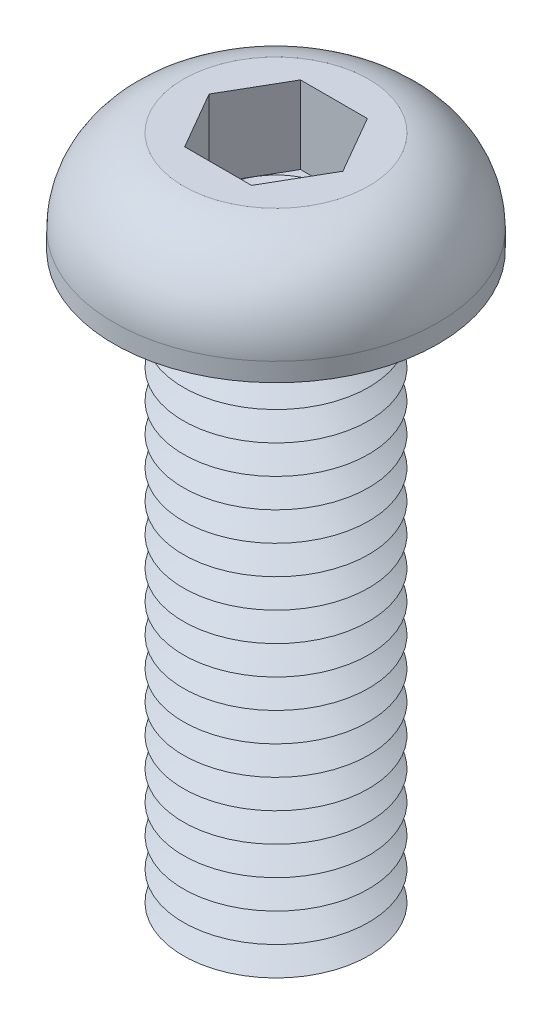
ISO-10303-21;
HEADER;
FILE_DESCRIPTION(('STEP AP214'),'2;1');
FILE_NAME('part.step','',(''),(''),'','','');
FILE_SCHEMA(('AUTOMOTIVE_DESIGN { 1 0 10303 214 1 1 1 1 }'));
ENDSEC;
DATA;
#1=APPLICATION_CONTEXT('core data for automotive mechanical design processes');
#2=APPLICATION_PROTOCOL_DEFINITION('international standard','automotive_design',2000,#1);
#3=PRODUCT_CONTEXT('',#1,'mechanical');
#4=PRODUCT('Part','Part','',(#3));
#5=PRODUCT_RELATED_PRODUCT_CATEGORY('part','',(#4));
#6=PRODUCT_DEFINITION_FORMATION('','',#4);
#7=PRODUCT_DEFINITION_CONTEXT('part definition',#1,'design');
#8=PRODUCT_DEFINITION('design','',#6,#7);
#9=PRODUCT_DEFINITION_SHAPE('','',#8);
#10=(LENGTH_UNIT() NAMED_UNIT(*) SI_UNIT(.MILLI.,.METRE.));
#11=(NAMED_UNIT(*) PLANE_ANGLE_UNIT() SI_UNIT($,.RADIAN.));
#12=(NAMED_UNIT(*) SI_UNIT($,.STERADIAN.) SOLID_ANGLE_UNIT());
#13=UNCERTAINTY_MEASURE_WITH_UNIT(LENGTH_MEASURE(1.E-05),#10,'distance_accuracy_value','');
#14=(GEOMETRIC_REPRESENTATION_CONTEXT(3) GLOBAL_UNCERTAINTY_ASSIGNED_CONTEXT((#13)) GLOBAL_UNIT_ASSIGNED_CONTEXT((#10,
#11,#12)) REPRESENTATION_CONTEXT('',''));
#15=CARTESIAN_POINT('',(0.,0.,0.));
#16=DIRECTION('',(0.,0.,1.));
#17=DIRECTION('',(1.,0.,0.));
#18=AXIS2_PLACEMENT_3D('',#15,#16,#17);
#19=CARTESIAN_POINT('',(0.,0.,0.));
#20=DIRECTION('',(0.,-1.,0.));
#21=DIRECTION('',(0.,0.,-1.));
#22=AXIS2_PLACEMENT_3D('',#19,#20,#21);
#23=TOROIDAL_SURFACE('',#22,4.625,0.625);
#24=CARTESIAN_POINT('',(0.,0.,-5.25));
#25=VERTEX_POINT('',#24);
#26=VERTEX_LOOP('',#25);
#27=FACE_BOUND('',#26,.T.);
#28=ADVANCED_FACE('P0_F12',(#27),#23,.T.);
#29=CLOSED_SHELL('',(#28));
#30=MANIFOLD_SOLID_BREP('P0_B1',#29);
#31=CARTESIAN_POINT('',(1.44337567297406,1.05,-2.5));
#32=DIRECTION('',(0.,1.,0.));
#33=DIRECTION('',(0.,0.,1.));
#34=AXIS2_PLACEMENT_3D('',#31,#32,#33);
#35=PLANE('',#34);
#36=CARTESIAN_POINT('',(0.,1.05,0.));
#37=DIRECTION('',(0.,1.,0.));
#38=DIRECTION('',(0.,0.,1.));
#39=AXIS2_PLACEMENT_3D('',#36,#37,#38);
#40=CIRCLE('',#39,2.5);
#41=CARTESIAN_POINT('',(0.,1.05,2.5));
#42=VERTEX_POINT('',#41);
#43=CARTESIAN_POINT('',(2.1650635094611,1.05,1.25));
#44=VERTEX_POINT('',#43);
#45=EDGE_CURVE('P1_E93',#42,#44,#40,.T.);
#46=ORIENTED_EDGE('',*,*,#45,.F.);
#47=DIRECTION('',(1.,0.,0.));
#48=VECTOR('',#47,1.);
#49=CARTESIAN_POINT('',(-1.44337567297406,1.05,2.5));
#50=LINE('',#49,#48);
#51=CARTESIAN_POINT('',(1.44337567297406,1.05,2.5));
#52=VERTEX_POINT('',#51);
#53=EDGE_CURVE('P1_E116',#42,#52,#50,.T.);
#54=ORIENTED_EDGE('',*,*,#53,.T.);
#55=DIRECTION('',(0.5,0.,-0.866025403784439));
#56=VECTOR('',#55,1.);
#57=CARTESIAN_POINT('',(1.44337567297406,1.05,2.5));
#58=LINE('',#57,#56);
#59=EDGE_CURVE('P1_E112',#52,#44,#58,.T.);
#60=ORIENTED_EDGE('',*,*,#59,.T.);
#61=EDGE_LOOP('',(#46,#54,#60));
#62=FACE_BOUND('',#61,.T.);
#63=ADVANCED_FACE('P1_F15',(#62),#35,.T.);
#64=CARTESIAN_POINT('',(0.,1.05,0.));
#65=DIRECTION('',(0.,1.,0.));
#66=DIRECTION('',(0.,0.,1.));
#67=AXIS2_PLACEMENT_3D('',#64,#65,#66);
#68=CIRCLE('',#67,2.5);
#69=CARTESIAN_POINT('',(2.1650635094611,1.05,-1.25));
#70=VERTEX_POINT('',#69);
#71=EDGE_CURVE('P1_E10',#44,#70,#68,.T.);
#72=ORIENTED_EDGE('',*,*,#71,.F.);
#73=CARTESIAN_POINT('',(2.88675134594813,1.05,0.));
#74=VERTEX_POINT('',#73);
#75=EDGE_CURVE('P1_E104',#44,#74,#58,.T.);
#76=ORIENTED_EDGE('',*,*,#75,.T.);
#77=DIRECTION('',(-0.5,0.,-0.866025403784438));
#78=VECTOR('',#77,1.);
#79=CARTESIAN_POINT('',(2.88675134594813,1.05,0.));
#80=LINE('',#79,#78);
#81=EDGE_CURVE('P1_E107',#74,#70,#80,.T.);
#82=ORIENTED_EDGE('',*,*,#81,.T.);
#83=EDGE_LOOP('',(#72,#76,#82));
#84=FACE_BOUND('',#83,.T.);
#85=ADVANCED_FACE('P1_F103',(#84),#35,.T.);
#86=CARTESIAN_POINT('',(0.,1.05,-2.5));
#87=VERTEX_POINT('',#86);
#88=EDGE_CURVE('P1_E24',#70,#87,#68,.T.);
#89=ORIENTED_EDGE('',*,*,#88,.F.);
#90=CARTESIAN_POINT('',(1.44337567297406,1.05,-2.5));
#91=VERTEX_POINT('',#90);
#92=EDGE_CURVE('P1_E139',#70,#91,#80,.T.);
#93=ORIENTED_EDGE('',*,*,#92,.T.);
#94=DIRECTION('',(-1.,0.,0.));
#95=VECTOR('',#94,1.);
#96=CARTESIAN_POINT('',(1.44337567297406,1.05,-2.5));
#97=LINE('',#96,#95);
#98=EDGE_CURVE('P1_E336',#91,#87,#97,.T.);
#99=ORIENTED_EDGE('',*,*,#98,.T.);
#100=EDGE_LOOP('',(#89,#93,#99));
#101=FACE_BOUND('',#100,.T.);
#102=ADVANCED_FACE('P1_F301',(#101),#35,.T.);
#103=CARTESIAN_POINT('',(-2.1650635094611,1.05,-1.25));
#104=VERTEX_POINT('',#103);
#105=EDGE_CURVE('P1_E331',#87,#104,#68,.T.);
#106=ORIENTED_EDGE('',*,*,#105,.F.);
#107=CARTESIAN_POINT('',(-1.44337567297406,1.05,-2.5));
#108=VERTEX_POINT('',#107);
#109=EDGE_CURVE('P1_E340',#87,#108,#97,.T.);
#110=ORIENTED_EDGE('',*,*,#109,.T.);
#111=DIRECTION('',(-0.5,0.,0.866025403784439));
#112=VECTOR('',#111,1.);
#113=CARTESIAN_POINT('',(-1.44337567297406,1.05,-2.5));
#114=LINE('',#113,#112);
#115=EDGE_CURVE('P1_E335',#108,#104,#114,.T.);
#116=ORIENTED_EDGE('',*,*,#115,.T.);
#117=EDGE_LOOP('',(#106,#110,#116));
#118=FACE_BOUND('',#117,.T.);
#119=ADVANCED_FACE('P1_F315',(#118),#35,.T.);
#120=CARTESIAN_POINT('',(-2.1650635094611,1.05,1.25));
#121=VERTEX_POINT('',#120);
#122=EDGE_CURVE('P1_E31',#104,#121,#68,.T.);
#123=ORIENTED_EDGE('',*,*,#122,.F.);
#124=CARTESIAN_POINT('',(-2.88675134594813,1.05,0.));
#125=VERTEX_POINT('',#124);
#126=EDGE_CURVE('P1_E327',#104,#125,#114,.T.);
#127=ORIENTED_EDGE('',*,*,#126,.T.);
#128=DIRECTION('',(0.5,0.,0.866025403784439));
#129=VECTOR('',#128,1.);
#130=CARTESIAN_POINT('',(-2.88675134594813,1.05,0.));
#131=LINE('',#130,#129);
#132=EDGE_CURVE('P1_E330',#125,#121,#131,.T.);
#133=ORIENTED_EDGE('',*,*,#132,.T.);
#134=EDGE_LOOP('',(#123,#127,#133));
#135=FACE_BOUND('',#134,.T.);
#136=ADVANCED_FACE('P1_F306',(#135),#35,.T.);
#137=CARTESIAN_POINT('',(0.,-23.75,0.));
#138=DIRECTION('',(0.,1.,0.));
#139=DIRECTION('',(0.,0.,1.));
#140=AXIS2_PLACEMENT_3D('',#137,#138,#139);
#141=CONICAL_SURFACE('',#140,2.91746824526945,1.0471975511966);
#142=CARTESIAN_POINT('',(0.,-23.125,0.));
#143=DIRECTION('',(0.,-1.,0.));
#144=DIRECTION('',(0.,0.,-1.));
#145=AXIS2_PLACEMENT_3D('',#142,#143,#144);
#146=CIRCLE('',#145,4.);
#147=CARTESIAN_POINT('',(0.,-23.125,-4.));
#148=VERTEX_POINT('',#147);
#149=EDGE_CURVE('P1_E263',#148,#148,#146,.T.);
#150=ORIENTED_EDGE('',*,*,#149,.T.);
#151=EDGE_LOOP('',(#150));
#152=FACE_BOUND('',#151,.T.);
#153=CARTESIAN_POINT('',(0.,-23.75,0.));
#154=DIRECTION('',(0.,-1.,0.));
#155=DIRECTION('',(0.,0.,-1.));
#156=AXIS2_PLACEMENT_3D('',#153,#154,#155);
#157=CIRCLE('',#156,2.91746824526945);
#158=CARTESIAN_POINT('',(0.,-23.75,-2.91746824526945));
#159=VERTEX_POINT('',#158);
#160=EDGE_CURVE('P1_E266',#159,#159,#157,.T.);
#161=ORIENTED_EDGE('',*,*,#160,.F.);
#162=EDGE_LOOP('',(#161));
#163=FACE_BOUND('',#162,.T.);
#164=ADVANCED_FACE('P1_F314',(#152,#163),#141,.T.);
#165=CARTESIAN_POINT('',(0.,-24.375,0.));
#166=DIRECTION('',(0.,-1.,0.));
#167=DIRECTION('',(0.,0.,-1.));
#168=AXIS2_PLACEMENT_3D('',#165,#166,#167);
#169=CONICAL_SURFACE('',#168,4.,1.0471975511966);
#170=ORIENTED_EDGE('',*,*,#160,.T.);
#171=EDGE_LOOP('',(#170));
#172=FACE_BOUND('',#171,.T.);
#173=CARTESIAN_POINT('',(0.,-24.375,0.));
#174=DIRECTION('',(0.,-1.,0.));
#175=DIRECTION('',(0.,0.,-1.));
#176=AXIS2_PLACEMENT_3D('',#173,#174,#175);
#177=CIRCLE('',#176,4.);
#178=CARTESIAN_POINT('',(0.,-24.375,-4.));
#179=VERTEX_POINT('',#178);
#180=EDGE_CURVE('P1_E269',#179,#179,#177,.T.);
#181=ORIENTED_EDGE('',*,*,#180,.F.);
#182=EDGE_LOOP('',(#181));
#183=FACE_BOUND('',#182,.T.);
#184=ADVANCED_FACE('P1_F321',(#172,#183),#169,.T.);
#185=CARTESIAN_POINT('',(0.,-25.,0.));
#186=DIRECTION('',(0.,1.,0.));
#187=DIRECTION('',(0.,0.,1.));
#188=AXIS2_PLACEMENT_3D('',#185,#186,#187);
#189=PLANE('',#188);
#190=CARTESIAN_POINT('',(0.,-25.,0.));
#191=DIRECTION('',(0.,-1.,0.));
#192=DIRECTION('',(0.,0.,-1.));
#193=AXIS2_PLACEMENT_3D('',#190,#191,#192);
#194=CIRCLE('',#193,2.91746824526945);
#195=CARTESIAN_POINT('',(0.,-25.,-2.91746824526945));
#196=VERTEX_POINT('',#195);
#197=EDGE_CURVE('P1_E272',#196,#196,#194,.T.);
#198=ORIENTED_EDGE('',*,*,#197,.T.);
#199=EDGE_LOOP('',(#198));
#200=FACE_BOUND('',#199,.T.);
#201=ADVANCED_FACE('P1_F399',(#200),#189,.F.);
#202=CARTESIAN_POINT('',(0.,-25.,0.));
#203=DIRECTION('',(0.,1.,0.));
#204=DIRECTION('',(0.,0.,1.));
#205=AXIS2_PLACEMENT_3D('',#202,#203,#204);
#206=CONICAL_SURFACE('',#205,2.91746824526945,1.0471975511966);
#207=ORIENTED_EDGE('',*,*,#180,.T.);
#208=EDGE_LOOP('',(#207));
#209=FACE_BOUND('',#208,.T.);
#210=ORIENTED_EDGE('',*,*,#197,.F.);
#211=EDGE_LOOP('',(#210));
#212=FACE_BOUND('',#211,.T.);
#213=ADVANCED_FACE('P1_F410',(#209,#212),#206,.T.);
#214=CARTESIAN_POINT('',(0.,-22.5,0.));
#215=DIRECTION('',(0.,1.,0.));
#216=DIRECTION('',(0.,0.,1.));
#217=AXIS2_PLACEMENT_3D('',#214,#215,#216);
#218=CONICAL_SURFACE('',#217,2.91746824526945,1.0471975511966);
#219=CARTESIAN_POINT('',(0.,-21.875,0.));
#220=DIRECTION('',(0.,-1.,0.));
#221=DIRECTION('',(0.,0.,-1.));
#222=AXIS2_PLACEMENT_3D('',#219,#220,#221);
#223=CIRCLE('',#222,4.);
#224=CARTESIAN_POINT('',(0.,-21.875,-4.));
#225=VERTEX_POINT('',#224);
#226=EDGE_CURVE('P1_E257',#225,#225,#223,.T.);
#227=ORIENTED_EDGE('',*,*,#226,.T.);
#228=EDGE_LOOP('',(#227));
#229=FACE_BOUND('',#228,.T.);
#230=CARTESIAN_POINT('',(0.,-22.5,0.));
#231=DIRECTION('',(0.,-1.,0.));
#232=DIRECTION('',(0.,0.,-1.));
#233=AXIS2_PLACEMENT_3D('',#230,#231,#232);
#234=CIRCLE('',#233,2.91746824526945);
#235=CARTESIAN_POINT('',(0.,-22.5,-2.91746824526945));
#236=VERTEX_POINT('',#235);
#237=EDGE_CURVE('P1_E260',#236,#236,#234,.T.);
#238=ORIENTED_EDGE('',*,*,#237,.F.);
#239=EDGE_LOOP('',(#238));
#240=FACE_BOUND('',#239,.T.);
#241=ADVANCED_FACE('P1_F419',(#229,#240),#218,.T.);
#242=CARTESIAN_POINT('',(0.,-23.125,0.));
#243=DIRECTION('',(0.,-1.,0.));
#244=DIRECTION('',(0.,0.,-1.));
#245=AXIS2_PLACEMENT_3D('',#242,#243,#244);
#246=CONICAL_SURFACE('',#245,4.,1.0471975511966);
#247=ORIENTED_EDGE('',*,*,#237,.T.);
#248=EDGE_LOOP('',(#247));
#249=FACE_BOUND('',#248,.T.);
#250=ORIENTED_EDGE('',*,*,#149,.F.);
#251=EDGE_LOOP('',(#250));
#252=FACE_BOUND('',#251,.T.);
#253=ADVANCED_FACE('P1_F428',(#249,#252),#246,.T.);
#254=CARTESIAN_POINT('',(0.,-21.25,0.));
#255=DIRECTION('',(0.,1.,0.));
#256=DIRECTION('',(0.,0.,1.));
#257=AXIS2_PLACEMENT_3D('',#254,#255,#256);
#258=CONICAL_SURFACE('',#257,2.91746824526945,1.0471975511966);
#259=CARTESIAN_POINT('',(0.,-20.625,0.));
#260=DIRECTION('',(0.,-1.,0.));
#261=DIRECTION('',(0.,0.,-1.));
#262=AXIS2_PLACEMENT_3D('',#259,#260,#261);
#263=CIRCLE('',#262,4.);
#264=CARTESIAN_POINT('',(0.,-20.625,-4.));
#265=VERTEX_POINT('',#264);
#266=EDGE_CURVE('P1_E251',#265,#265,#263,.T.);
#267=ORIENTED_EDGE('',*,*,#266,.T.);
#268=EDGE_LOOP('',(#267));
#269=FACE_BOUND('',#268,.T.);
#270=CARTESIAN_POINT('',(0.,-21.25,0.));
#271=DIRECTION('',(0.,-1.,0.));
#272=DIRECTION('',(0.,0.,-1.));
#273=AXIS2_PLACEMENT_3D('',#270,#271,#272);
#274=CIRCLE('',#273,2.91746824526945);
#275=CARTESIAN_POINT('',(0.,-21.25,-2.91746824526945));
#276=VERTEX_POINT('',#275);
#277=EDGE_CURVE('P1_E254',#276,#276,#274,.T.);
#278=ORIENTED_EDGE('',*,*,#277,.F.);
#279=EDGE_LOOP('',(#278));
#280=FACE_BOUND('',#279,.T.);
#281=ADVANCED_FACE('P1_F438',(#269,#280),#258,.T.);
#282=CARTESIAN_POINT('',(0.,-21.875,0.));
#283=DIRECTION('',(0.,-1.,0.));
#284=DIRECTION('',(0.,0.,-1.));
#285=AXIS2_PLACEMENT_3D('',#282,#283,#284);
#286=CONICAL_SURFACE('',#285,4.,1.0471975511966);
#287=ORIENTED_EDGE('',*,*,#277,.T.);
#288=EDGE_LOOP('',(#287));
#289=FACE_BOUND('',#288,.T.);
#290=ORIENTED_EDGE('',*,*,#226,.F.);
#291=EDGE_LOOP('',(#290));
#292=FACE_BOUND('',#291,.T.);
#293=ADVANCED_FACE('P1_F448',(#289,#292),#286,.T.);
#294=CARTESIAN_POINT('',(0.,-20.,0.));
#295=DIRECTION('',(0.,1.,0.));
#296=DIRECTION('',(0.,0.,1.));
#297=AXIS2_PLACEMENT_3D('',#294,#295,#296);
#298=CONICAL_SURFACE('',#297,2.91746824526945,1.0471975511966);
#299=CARTESIAN_POINT('',(0.,-19.375,0.));
#300=DIRECTION('',(0.,-1.,0.));
#301=DIRECTION('',(0.,0.,-1.));
#302=AXIS2_PLACEMENT_3D('',#299,#300,#301);
#303=CIRCLE('',#302,4.);
#304=CARTESIAN_POINT('',(0.,-19.375,-4.));
#305=VERTEX_POINT('',#304);
#306=EDGE_CURVE('P1_E245',#305,#305,#303,.T.);
#307=ORIENTED_EDGE('',*,*,#306,.T.);
#308=EDGE_LOOP('',(#307));
#309=FACE_BOUND('',#308,.T.);
#310=CARTESIAN_POINT('',(0.,-20.,0.));
#311=DIRECTION('',(0.,-1.,0.));
#312=DIRECTION('',(0.,0.,-1.));
#313=AXIS2_PLACEMENT_3D('',#310,#311,#312);
#314=CIRCLE('',#313,2.91746824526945);
#315=CARTESIAN_POINT('',(0.,-20.,-2.91746824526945));
#316=VERTEX_POINT('',#315);
#317=EDGE_CURVE('P1_E248',#316,#316,#314,.T.);
#318=ORIENTED_EDGE('',*,*,#317,.F.);
#319=EDGE_LOOP('',(#318));
#320=FACE_BOUND('',#319,.T.);
#321=ADVANCED_FACE('P1_F458',(#309,#320),#298,.T.);
#322=CARTESIAN_POINT('',(0.,-20.625,0.));
#323=DIRECTION('',(0.,-1.,0.));
#324=DIRECTION('',(0.,0.,-1.));
#325=AXIS2_PLACEMENT_3D('',#322,#323,#324);
#326=CONICAL_SURFACE('',#325,4.,1.0471975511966);
#327=ORIENTED_EDGE('',*,*,#317,.T.);
#328=EDGE_LOOP('',(#327));
#329=FACE_BOUND('',#328,.T.);
#330=ORIENTED_EDGE('',*,*,#266,.F.);
#331=EDGE_LOOP('',(#330));
#332=FACE_BOUND('',#331,.T.);
#333=ADVANCED_FACE('P1_F468',(#329,#332),#326,.T.);
#334=CARTESIAN_POINT('',(0.,-18.75,0.));
#335=DIRECTION('',(0.,1.,0.));
#336=DIRECTION('',(0.,0.,1.));
#337=AXIS2_PLACEMENT_3D('',#334,#335,#336);
#338=CONICAL_SURFACE('',#337,2.91746824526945,1.0471975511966);
#339=CARTESIAN_POINT('',(0.,-18.125,0.));
#340=DIRECTION('',(0.,-1.,0.));
#341=DIRECTION('',(0.,0.,-1.));
#342=AXIS2_PLACEMENT_3D('',#339,#340,#341);
#343=CIRCLE('',#342,4.);
#344=CARTESIAN_POINT('',(0.,-18.125,-4.));
#345=VERTEX_POINT('',#344);
#346=EDGE_CURVE('P1_E239',#345,#345,#343,.T.);
#347=ORIENTED_EDGE('',*,*,#346,.T.);
#348=EDGE_LOOP('',(#347));
#349=FACE_BOUND('',#348,.T.);
#350=CARTESIAN_POINT('',(0.,-18.75,0.));
#351=DIRECTION('',(0.,-1.,0.));
#352=DIRECTION('',(0.,0.,-1.));
#353=AXIS2_PLACEMENT_3D('',#350,#351,#352);
#354=CIRCLE('',#353,2.91746824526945);
#355=CARTESIAN_POINT('',(0.,-18.75,-2.91746824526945));
#356=VERTEX_POINT('',#355);
#357=EDGE_CURVE('P1_E242',#356,#356,#354,.T.);
#358=ORIENTED_EDGE('',*,*,#357,.F.);
#359=EDGE_LOOP('',(#358));
#360=FACE_BOUND('',#359,.T.);
#361=ADVANCED_FACE('P1_F478',(#349,#360),#338,.T.);
#362=CARTESIAN_POINT('',(0.,-19.375,0.));
#363=DIRECTION('',(0.,-1.,0.));
#364=DIRECTION('',(0.,0.,-1.));
#365=AXIS2_PLACEMENT_3D('',#362,#363,#364);
#366=CONICAL_SURFACE('',#365,4.,1.0471975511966);
#367=ORIENTED_EDGE('',*,*,#357,.T.);
#368=EDGE_LOOP('',(#367));
#369=FACE_BOUND('',#368,.T.);
#370=ORIENTED_EDGE('',*,*,#306,.F.);
#371=EDGE_LOOP('',(#370));
#372=FACE_BOUND('',#371,.T.);
#373=ADVANCED_FACE('P1_F488',(#369,#372),#366,.T.);
#374=CARTESIAN_POINT('',(0.,-17.5,0.));
#375=DIRECTION('',(0.,1.,0.));
#376=DIRECTION('',(0.,0.,1.));
#377=AXIS2_PLACEMENT_3D('',#374,#375,#376);
#378=CONICAL_SURFACE('',#377,2.91746824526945,1.0471975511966);
#379=CARTESIAN_POINT('',(0.,-16.875,0.));
#380=DIRECTION('',(0.,-1.,0.));
#381=DIRECTION('',(0.,0.,-1.));
#382=AXIS2_PLACEMENT_3D('',#379,#380,#381);
#383=CIRCLE('',#382,4.);
#384=CARTESIAN_POINT('',(0.,-16.875,-4.));
#385=VERTEX_POINT('',#384);
#386=EDGE_CURVE('P1_E233',#385,#385,#383,.T.);
#387=ORIENTED_EDGE('',*,*,#386,.T.);
#388=EDGE_LOOP('',(#387));
#389=FACE_BOUND('',#388,.T.);
#390=CARTESIAN_POINT('',(0.,-17.5,0.));
#391=DIRECTION('',(0.,-1.,0.));
#392=DIRECTION('',(0.,0.,-1.));
#393=AXIS2_PLACEMENT_3D('',#390,#391,#392);
#394=CIRCLE('',#393,2.91746824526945);
#395=CARTESIAN_POINT('',(0.,-17.5,-2.91746824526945));
#396=VERTEX_POINT('',#395);
#397=EDGE_CURVE('P1_E236',#396,#396,#394,.T.);
#398=ORIENTED_EDGE('',*,*,#397,.F.);
#399=EDGE_LOOP('',(#398));
#400=FACE_BOUND('',#399,.T.);
#401=ADVANCED_FACE('P1_F498',(#389,#400),#378,.T.);
#402=CARTESIAN_POINT('',(0.,-18.125,0.));
#403=DIRECTION('',(0.,-1.,0.));
#404=DIRECTION('',(0.,0.,-1.));
#405=AXIS2_PLACEMENT_3D('',#402,#403,#404);
#406=CONICAL_SURFACE('',#405,4.,1.0471975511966);
#407=ORIENTED_EDGE('',*,*,#397,.T.);
#408=EDGE_LOOP('',(#407));
#409=FACE_BOUND('',#408,.T.);
#410=ORIENTED_EDGE('',*,*,#346,.F.);
#411=EDGE_LOOP('',(#410));
#412=FACE_BOUND('',#411,.T.);
#413=ADVANCED_FACE('P1_F508',(#409,#412),#406,.T.);
#414=CARTESIAN_POINT('',(0.,-16.25,0.));
#415=DIRECTION('',(0.,1.,0.));
#416=DIRECTION('',(0.,0.,1.));
#417=AXIS2_PLACEMENT_3D('',#414,#415,#416);
#418=CONICAL_SURFACE('',#417,2.91746824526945,1.0471975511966);
#419=CARTESIAN_POINT('',(0.,-15.625,0.));
#420=DIRECTION('',(0.,-1.,0.));
#421=DIRECTION('',(0.,0.,-1.));
#422=AXIS2_PLACEMENT_3D('',#419,#420,#421);
#423=CIRCLE('',#422,4.);
#424=CARTESIAN_POINT('',(0.,-15.625,-4.));
#425=VERTEX_POINT('',#424);
#426=EDGE_CURVE('P1_E227',#425,#425,#423,.T.);
#427=ORIENTED_EDGE('',*,*,#426,.T.);
#428=EDGE_LOOP('',(#427));
#429=FACE_BOUND('',#428,.T.);
#430=CARTESIAN_POINT('',(0.,-16.25,0.));
#431=DIRECTION('',(0.,-1.,0.));
#432=DIRECTION('',(0.,0.,-1.));
#433=AXIS2_PLACEMENT_3D('',#430,#431,#432);
#434=CIRCLE('',#433,2.91746824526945);
#435=CARTESIAN_POINT('',(0.,-16.25,-2.91746824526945));
#436=VERTEX_POINT('',#435);
#437=EDGE_CURVE('P1_E230',#436,#436,#434,.T.);
#438=ORIENTED_EDGE('',*,*,#437,.F.);
#439=EDGE_LOOP('',(#438));
#440=FACE_BOUND('',#439,.T.);
#441=ADVANCED_FACE('P1_F518',(#429,#440),#418,.T.);
#442=CARTESIAN_POINT('',(0.,-16.875,0.));
#443=DIRECTION('',(0.,-1.,0.));
#444=DIRECTION('',(0.,0.,-1.));
#445=AXIS2_PLACEMENT_3D('',#442,#443,#444);
#446=CONICAL_SURFACE('',#445,4.,1.0471975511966);
#447=ORIENTED_EDGE('',*,*,#437,.T.);
#448=EDGE_LOOP('',(#447));
#449=FACE_BOUND('',#448,.T.);
#450=ORIENTED_EDGE('',*,*,#386,.F.);
#451=EDGE_LOOP('',(#450));
#452=FACE_BOUND('',#451,.T.);
#453=ADVANCED_FACE('P1_F528',(#449,#452),#446,.T.);
#454=CARTESIAN_POINT('',(0.,-15.,0.));
#455=DIRECTION('',(0.,1.,0.));
#456=DIRECTION('',(0.,0.,1.));
#457=AXIS2_PLACEMENT_3D('',#454,#455,#456);
#458=CONICAL_SURFACE('',#457,2.91746824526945,1.0471975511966);
#459=CARTESIAN_POINT('',(0.,-14.375,0.));
#460=DIRECTION('',(0.,-1.,0.));
#461=DIRECTION('',(0.,0.,-1.));
#462=AXIS2_PLACEMENT_3D('',#459,#460,#461);
#463=CIRCLE('',#462,4.);
#464=CARTESIAN_POINT('',(0.,-14.375,-4.));
#465=VERTEX_POINT('',#464);
#466=EDGE_CURVE('P1_E221',#465,#465,#463,.T.);
#467=ORIENTED_EDGE('',*,*,#466,.T.);
#468=EDGE_LOOP('',(#467));
#469=FACE_BOUND('',#468,.T.);
#470=CARTESIAN_POINT('',(0.,-15.,0.));
#471=DIRECTION('',(0.,-1.,0.));
#472=DIRECTION('',(0.,0.,-1.));
#473=AXIS2_PLACEMENT_3D('',#470,#471,#472);
#474=CIRCLE('',#473,2.91746824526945);
#475=CARTESIAN_POINT('',(0.,-15.,-2.91746824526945));
#476=VERTEX_POINT('',#475);
#477=EDGE_CURVE('P1_E224',#476,#476,#474,.T.);
#478=ORIENTED_EDGE('',*,*,#477,.F.);
#479=EDGE_LOOP('',(#478));
#480=FACE_BOUND('',#479,.T.);
#481=ADVANCED_FACE('P1_F538',(#469,#480),#458,.T.);
#482=CARTESIAN_POINT('',(0.,-15.625,0.));
#483=DIRECTION('',(0.,-1.,0.));
#484=DIRECTION('',(0.,0.,-1.));
#485=AXIS2_PLACEMENT_3D('',#482,#483,#484);
#486=CONICAL_SURFACE('',#485,4.,1.0471975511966);
#487=ORIENTED_EDGE('',*,*,#477,.T.);
#488=EDGE_LOOP('',(#487));
#489=FACE_BOUND('',#488,.T.);
#490=ORIENTED_EDGE('',*,*,#426,.F.);
#491=EDGE_LOOP('',(#490));
#492=FACE_BOUND('',#491,.T.);
#493=ADVANCED_FACE('P1_F548',(#489,#492),#486,.T.);
#494=CARTESIAN_POINT('',(0.,-13.75,0.));
#495=DIRECTION('',(0.,1.,0.));
#496=DIRECTION('',(0.,0.,1.));
#497=AXIS2_PLACEMENT_3D('',#494,#495,#496);
#498=CONICAL_SURFACE('',#497,2.91746824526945,1.0471975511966);
#499=CARTESIAN_POINT('',(0.,-13.125,0.));
#500=DIRECTION('',(0.,-1.,0.));
#501=DIRECTION('',(0.,0.,-1.));
#502=AXIS2_PLACEMENT_3D('',#499,#500,#501);
#503=CIRCLE('',#502,4.);
#504=CARTESIAN_POINT('',(0.,-13.125,-4.));
#505=VERTEX_POINT('',#504);
#506=EDGE_CURVE('P1_E215',#505,#505,#503,.T.);
#507=ORIENTED_EDGE('',*,*,#506,.T.);
#508=EDGE_LOOP('',(#507));
#509=FACE_BOUND('',#508,.T.);
#510=CARTESIAN_POINT('',(0.,-13.75,0.));
#511=DIRECTION('',(0.,-1.,0.));
#512=DIRECTION('',(0.,0.,-1.));
#513=AXIS2_PLACEMENT_3D('',#510,#511,#512);
#514=CIRCLE('',#513,2.91746824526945);
#515=CARTESIAN_POINT('',(0.,-13.75,-2.91746824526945));
#516=VERTEX_POINT('',#515);
#517=EDGE_CURVE('P1_E218',#516,#516,#514,.T.);
#518=ORIENTED_EDGE('',*,*,#517,.F.);
#519=EDGE_LOOP('',(#518));
#520=FACE_BOUND('',#519,.T.);
#521=ADVANCED_FACE('P1_F558',(#509,#520),#498,.T.);
#522=CARTESIAN_POINT('',(0.,-14.375,0.));
#523=DIRECTION('',(0.,-1.,0.));
#524=DIRECTION('',(0.,0.,-1.));
#525=AXIS2_PLACEMENT_3D('',#522,#523,#524);
#526=CONICAL_SURFACE('',#525,4.,1.0471975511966);
#527=ORIENTED_EDGE('',*,*,#517,.T.);
#528=EDGE_LOOP('',(#527));
#529=FACE_BOUND('',#528,.T.);
#530=ORIENTED_EDGE('',*,*,#466,.F.);
#531=EDGE_LOOP('',(#530));
#532=FACE_BOUND('',#531,.T.);
#533=ADVANCED_FACE('P1_F568',(#529,#532),#526,.T.);
#534=CARTESIAN_POINT('',(0.,-12.5,0.));
#535=DIRECTION('',(0.,1.,0.));
#536=DIRECTION('',(0.,0.,1.));
#537=AXIS2_PLACEMENT_3D('',#534,#535,#536);
#538=CONICAL_SURFACE('',#537,2.91746824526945,1.0471975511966);
#539=CARTESIAN_POINT('',(0.,-11.875,0.));
#540=DIRECTION('',(0.,-1.,0.));
#541=DIRECTION('',(0.,0.,-1.));
#542=AXIS2_PLACEMENT_3D('',#539,#540,#541);
#543=CIRCLE('',#542,4.);
#544=CARTESIAN_POINT('',(0.,-11.875,-4.));
#545=VERTEX_POINT('',#544);
#546=EDGE_CURVE('P1_E209',#545,#545,#543,.T.);
#547=ORIENTED_EDGE('',*,*,#546,.T.);
#548=EDGE_LOOP('',(#547));
#549=FACE_BOUND('',#548,.T.);
#550=CARTESIAN_POINT('',(0.,-12.5,0.));
#551=DIRECTION('',(0.,-1.,0.));
#552=DIRECTION('',(0.,0.,-1.));
#553=AXIS2_PLACEMENT_3D('',#550,#551,#552);
#554=CIRCLE('',#553,2.91746824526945);
#555=CARTESIAN_POINT('',(0.,-12.5,-2.91746824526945));
#556=VERTEX_POINT('',#555);
#557=EDGE_CURVE('P1_E212',#556,#556,#554,.T.);
#558=ORIENTED_EDGE('',*,*,#557,.F.);
#559=EDGE_LOOP('',(#558));
#560=FACE_BOUND('',#559,.T.);
#561=ADVANCED_FACE('P1_F578',(#549,#560),#538,.T.);
#562=CARTESIAN_POINT('',(0.,-13.125,0.));
#563=DIRECTION('',(0.,-1.,0.));
#564=DIRECTION('',(0.,0.,-1.));
#565=AXIS2_PLACEMENT_3D('',#562,#563,#564);
#566=CONICAL_SURFACE('',#565,4.,1.0471975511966);
#567=ORIENTED_EDGE('',*,*,#557,.T.);
#568=EDGE_LOOP('',(#567));
#569=FACE_BOUND('',#568,.T.);
#570=ORIENTED_EDGE('',*,*,#506,.F.);
#571=EDGE_LOOP('',(#570));
#572=FACE_BOUND('',#571,.T.);
#573=ADVANCED_FACE('P1_F588',(#569,#572),#566,.T.);
#574=CARTESIAN_POINT('',(0.,-11.25,0.));
#575=DIRECTION('',(0.,1.,0.));
#576=DIRECTION('',(0.,0.,1.));
#577=AXIS2_PLACEMENT_3D('',#574,#575,#576);
#578=CONICAL_SURFACE('',#577,2.91746824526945,1.0471975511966);
#579=CARTESIAN_POINT('',(0.,-10.625,0.));
#580=DIRECTION('',(0.,-1.,0.));
#581=DIRECTION('',(0.,0.,-1.));
#582=AXIS2_PLACEMENT_3D('',#579,#580,#581);
#583=CIRCLE('',#582,4.);
#584=CARTESIAN_POINT('',(0.,-10.625,-4.));
#585=VERTEX_POINT('',#584);
#586=EDGE_CURVE('P1_E203',#585,#585,#583,.T.);
#587=ORIENTED_EDGE('',*,*,#586,.T.);
#588=EDGE_LOOP('',(#587));
#589=FACE_BOUND('',#588,.T.);
#590=CARTESIAN_POINT('',(0.,-11.25,0.));
#591=DIRECTION('',(0.,-1.,0.));
#592=DIRECTION('',(0.,0.,-1.));
#593=AXIS2_PLACEMENT_3D('',#590,#591,#592);
#594=CIRCLE('',#593,2.91746824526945);
#595=CARTESIAN_POINT('',(0.,-11.25,-2.91746824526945));
#596=VERTEX_POINT('',#595);
#597=EDGE_CURVE('P1_E206',#596,#596,#594,.T.);
#598=ORIENTED_EDGE('',*,*,#597,.F.);
#599=EDGE_LOOP('',(#598));
#600=FACE_BOUND('',#599,.T.);
#601=ADVANCED_FACE('P1_F598',(#589,#600),#578,.T.);
#602=CARTESIAN_POINT('',(0.,-11.875,0.));
#603=DIRECTION('',(0.,-1.,0.));
#604=DIRECTION('',(0.,0.,-1.));
#605=AXIS2_PLACEMENT_3D('',#602,#603,#604);
#606=CONICAL_SURFACE('',#605,4.,1.0471975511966);
#607=ORIENTED_EDGE('',*,*,#597,.T.);
#608=EDGE_LOOP('',(#607));
#609=FACE_BOUND('',#608,.T.);
#610=ORIENTED_EDGE('',*,*,#546,.F.);
#611=EDGE_LOOP('',(#610));
#612=FACE_BOUND('',#611,.T.);
#613=ADVANCED_FACE('P1_F608',(#609,#612),#606,.T.);
#614=CARTESIAN_POINT('',(0.,-10.,0.));
#615=DIRECTION('',(0.,1.,0.));
#616=DIRECTION('',(0.,0.,1.));
#617=AXIS2_PLACEMENT_3D('',#614,#615,#616);
#618=CONICAL_SURFACE('',#617,2.91746824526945,1.0471975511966);
#619=CARTESIAN_POINT('',(0.,-9.375,0.));
#620=DIRECTION('',(0.,-1.,0.));
#621=DIRECTION('',(0.,0.,-1.));
#622=AXIS2_PLACEMENT_3D('',#619,#620,#621);
#623=CIRCLE('',#622,4.);
#624=CARTESIAN_POINT('',(0.,-9.375,-4.));
#625=VERTEX_POINT('',#624);
#626=EDGE_CURVE('P1_E197',#625,#625,#623,.T.);
#627=ORIENTED_EDGE('',*,*,#626,.T.);
#628=EDGE_LOOP('',(#627));
#629=FACE_BOUND('',#628,.T.);
#630=CARTESIAN_POINT('',(0.,-10.,0.));
#631=DIRECTION('',(0.,-1.,0.));
#632=DIRECTION('',(0.,0.,-1.));
#633=AXIS2_PLACEMENT_3D('',#630,#631,#632);
#634=CIRCLE('',#633,2.91746824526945);
#635=CARTESIAN_POINT('',(0.,-10.,-2.91746824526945));
#636=VERTEX_POINT('',#635);
#637=EDGE_CURVE('P1_E200',#636,#636,#634,.T.);
#638=ORIENTED_EDGE('',*,*,#637,.F.);
#639=EDGE_LOOP('',(#638));
#640=FACE_BOUND('',#639,.T.);
#641=ADVANCED_FACE('P1_F618',(#629,#640),#618,.T.);
#642=CARTESIAN_POINT('',(0.,-10.625,0.));
#643=DIRECTION('',(0.,-1.,0.));
#644=DIRECTION('',(0.,0.,-1.));
#645=AXIS2_PLACEMENT_3D('',#642,#643,#644);
#646=CONICAL_SURFACE('',#645,4.,1.0471975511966);
#647=ORIENTED_EDGE('',*,*,#637,.T.);
#648=EDGE_LOOP('',(#647));
#649=FACE_BOUND('',#648,.T.);
#650=ORIENTED_EDGE('',*,*,#586,.F.);
#651=EDGE_LOOP('',(#650));
#652=FACE_BOUND('',#651,.T.);
#653=ADVANCED_FACE('P1_F628',(#649,#652),#646,.T.);
#654=CARTESIAN_POINT('',(0.,-8.75,0.));
#655=DIRECTION('',(0.,1.,0.));
#656=DIRECTION('',(0.,0.,1.));
#657=AXIS2_PLACEMENT_3D('',#654,#655,#656);
#658=CONICAL_SURFACE('',#657,2.91746824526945,1.0471975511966);
#659=CARTESIAN_POINT('',(0.,-8.125,0.));
#660=DIRECTION('',(0.,-1.,0.));
#661=DIRECTION('',(0.,0.,-1.));
#662=AXIS2_PLACEMENT_3D('',#659,#660,#661);
#663=CIRCLE('',#662,4.);
#664=CARTESIAN_POINT('',(0.,-8.125,-4.));
#665=VERTEX_POINT('',#664);
#666=EDGE_CURVE('P1_E191',#665,#665,#663,.T.);
#667=ORIENTED_EDGE('',*,*,#666,.T.);
#668=EDGE_LOOP('',(#667));
#669=FACE_BOUND('',#668,.T.);
#670=CARTESIAN_POINT('',(0.,-8.75,0.));
#671=DIRECTION('',(0.,-1.,0.));
#672=DIRECTION('',(0.,0.,-1.));
#673=AXIS2_PLACEMENT_3D('',#670,#671,#672);
#674=CIRCLE('',#673,2.91746824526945);
#675=CARTESIAN_POINT('',(0.,-8.75,-2.91746824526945));
#676=VERTEX_POINT('',#675);
#677=EDGE_CURVE('P1_E194',#676,#676,#674,.T.);
#678=ORIENTED_EDGE('',*,*,#677,.F.);
#679=EDGE_LOOP('',(#678));
#680=FACE_BOUND('',#679,.T.);
#681=ADVANCED_FACE('P1_F638',(#669,#680),#658,.T.);
#682=CARTESIAN_POINT('',(0.,-9.375,0.));
#683=DIRECTION('',(0.,-1.,0.));
#684=DIRECTION('',(0.,0.,-1.));
#685=AXIS2_PLACEMENT_3D('',#682,#683,#684);
#686=CONICAL_SURFACE('',#685,4.,1.0471975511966);
#687=ORIENTED_EDGE('',*,*,#677,.T.);
#688=EDGE_LOOP('',(#687));
#689=FACE_BOUND('',#688,.T.);
#690=ORIENTED_EDGE('',*,*,#626,.F.);
#691=EDGE_LOOP('',(#690));
#692=FACE_BOUND('',#691,.T.);
#693=ADVANCED_FACE('P1_F648',(#689,#692),#686,.T.);
#694=CARTESIAN_POINT('',(0.,-7.5,0.));
#695=DIRECTION('',(0.,1.,0.));
#696=DIRECTION('',(0.,0.,1.));
#697=AXIS2_PLACEMENT_3D('',#694,#695,#696);
#698=CONICAL_SURFACE('',#697,2.91746824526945,1.0471975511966);
#699=CARTESIAN_POINT('',(0.,-6.875,0.));
#700=DIRECTION('',(0.,-1.,0.));
#701=DIRECTION('',(0.,0.,-1.));
#702=AXIS2_PLACEMENT_3D('',#699,#700,#701);
#703=CIRCLE('',#702,4.);
#704=CARTESIAN_POINT('',(0.,-6.875,-4.));
#705=VERTEX_POINT('',#704);
#706=EDGE_CURVE('P1_E185',#705,#705,#703,.T.);
#707=ORIENTED_EDGE('',*,*,#706,.T.);
#708=EDGE_LOOP('',(#707));
#709=FACE_BOUND('',#708,.T.);
#710=CARTESIAN_POINT('',(0.,-7.5,0.));
#711=DIRECTION('',(0.,-1.,0.));
#712=DIRECTION('',(0.,0.,-1.));
#713=AXIS2_PLACEMENT_3D('',#710,#711,#712);
#714=CIRCLE('',#713,2.91746824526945);
#715=CARTESIAN_POINT('',(0.,-7.5,-2.91746824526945));
#716=VERTEX_POINT('',#715);
#717=EDGE_CURVE('P1_E188',#716,#716,#714,.T.);
#718=ORIENTED_EDGE('',*,*,#717,.F.);
#719=EDGE_LOOP('',(#718));
#720=FACE_BOUND('',#719,.T.);
#721=ADVANCED_FACE('P1_F658',(#709,#720),#698,.T.);
#722=CARTESIAN_POINT('',(0.,-8.125,0.));
#723=DIRECTION('',(0.,-1.,0.));
#724=DIRECTION('',(0.,0.,-1.));
#725=AXIS2_PLACEMENT_3D('',#722,#723,#724);
#726=CONICAL_SURFACE('',#725,4.,1.0471975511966);
#727=ORIENTED_EDGE('',*,*,#717,.T.);
#728=EDGE_LOOP('',(#727));
#729=FACE_BOUND('',#728,.T.);
#730=ORIENTED_EDGE('',*,*,#666,.F.);
#731=EDGE_LOOP('',(#730));
#732=FACE_BOUND('',#731,.T.);
#733=ADVANCED_FACE('P1_F668',(#729,#732),#726,.T.);
#734=CARTESIAN_POINT('',(0.,-6.25,0.));
#735=DIRECTION('',(0.,1.,0.));
#736=DIRECTION('',(0.,0.,1.));
#737=AXIS2_PLACEMENT_3D('',#734,#735,#736);
#738=CONICAL_SURFACE('',#737,2.91746824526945,1.0471975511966);
#739=CARTESIAN_POINT('',(0.,-5.625,0.));
#740=DIRECTION('',(0.,-1.,0.));
#741=DIRECTION('',(0.,0.,-1.));
#742=AXIS2_PLACEMENT_3D('',#739,#740,#741);
#743=CIRCLE('',#742,4.);
#744=CARTESIAN_POINT('',(0.,-5.625,-4.));
#745=VERTEX_POINT('',#744);
#746=EDGE_CURVE('P1_E179',#745,#745,#743,.T.);
#747=ORIENTED_EDGE('',*,*,#746,.T.);
#748=EDGE_LOOP('',(#747));
#749=FACE_BOUND('',#748,.T.);
#750=CARTESIAN_POINT('',(0.,-6.25,0.));
#751=DIRECTION('',(0.,-1.,0.));
#752=DIRECTION('',(0.,0.,-1.));
#753=AXIS2_PLACEMENT_3D('',#750,#751,#752);
#754=CIRCLE('',#753,2.91746824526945);
#755=CARTESIAN_POINT('',(0.,-6.25,-2.91746824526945));
#756=VERTEX_POINT('',#755);
#757=EDGE_CURVE('P1_E182',#756,#756,#754,.T.);
#758=ORIENTED_EDGE('',*,*,#757,.F.);
#759=EDGE_LOOP('',(#758));
#760=FACE_BOUND('',#759,.T.);
#761=ADVANCED_FACE('P1_F678',(#749,#760),#738,.T.);
#762=CARTESIAN_POINT('',(0.,-6.875,0.));
#763=DIRECTION('',(0.,-1.,0.));
#764=DIRECTION('',(0.,0.,-1.));
#765=AXIS2_PLACEMENT_3D('',#762,#763,#764);
#766=CONICAL_SURFACE('',#765,4.,1.0471975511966);
#767=ORIENTED_EDGE('',*,*,#757,.T.);
#768=EDGE_LOOP('',(#767));
#769=FACE_BOUND('',#768,.T.);
#770=ORIENTED_EDGE('',*,*,#706,.F.);
#771=EDGE_LOOP('',(#770));
#772=FACE_BOUND('',#771,.T.);
#773=ADVANCED_FACE('P1_F688',(#769,#772),#766,.T.);
#774=CARTESIAN_POINT('',(0.,-5.,0.));
#775=DIRECTION('',(0.,1.,0.));
#776=DIRECTION('',(0.,0.,1.));
#777=AXIS2_PLACEMENT_3D('',#774,#775,#776);
#778=CONICAL_SURFACE('',#777,2.91746824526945,1.0471975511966);
#779=CARTESIAN_POINT('',(0.,-4.375,0.));
#780=DIRECTION('',(0.,-1.,0.));
#781=DIRECTION('',(0.,0.,-1.));
#782=AXIS2_PLACEMENT_3D('',#779,#780,#781);
#783=CIRCLE('',#782,4.);
#784=CARTESIAN_POINT('',(0.,-4.375,-4.));
#785=VERTEX_POINT('',#784);
#786=EDGE_CURVE('P1_E173',#785,#785,#783,.T.);
#787=ORIENTED_EDGE('',*,*,#786,.T.);
#788=EDGE_LOOP('',(#787));
#789=FACE_BOUND('',#788,.T.);
#790=CARTESIAN_POINT('',(0.,-5.,0.));
#791=DIRECTION('',(0.,-1.,0.));
#792=DIRECTION('',(0.,0.,-1.));
#793=AXIS2_PLACEMENT_3D('',#790,#791,#792);
#794=CIRCLE('',#793,2.91746824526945);
#795=CARTESIAN_POINT('',(0.,-5.,-2.91746824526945));
#796=VERTEX_POINT('',#795);
#797=EDGE_CURVE('P1_E176',#796,#796,#794,.T.);
#798=ORIENTED_EDGE('',*,*,#797,.F.);
#799=EDGE_LOOP('',(#798));
#800=FACE_BOUND('',#799,.T.);
#801=ADVANCED_FACE('P1_F698',(#789,#800),#778,.T.);
#802=CARTESIAN_POINT('',(0.,-5.625,0.));
#803=DIRECTION('',(0.,-1.,0.));
#804=DIRECTION('',(0.,0.,-1.));
#805=AXIS2_PLACEMENT_3D('',#802,#803,#804);
#806=CONICAL_SURFACE('',#805,4.,1.0471975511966);
#807=ORIENTED_EDGE('',*,*,#797,.T.);
#808=EDGE_LOOP('',(#807));
#809=FACE_BOUND('',#808,.T.);
#810=ORIENTED_EDGE('',*,*,#746,.F.);
#811=EDGE_LOOP('',(#810));
#812=FACE_BOUND('',#811,.T.);
#813=ADVANCED_FACE('P1_F708',(#809,#812),#806,.T.);
#814=CARTESIAN_POINT('',(0.,-3.75,0.));
#815=DIRECTION('',(0.,1.,0.));
#816=DIRECTION('',(0.,0.,1.));
#817=AXIS2_PLACEMENT_3D('',#814,#815,#816);
#818=CONICAL_SURFACE('',#817,2.91746824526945,1.0471975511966);
#819=CARTESIAN_POINT('',(0.,-3.125,0.));
#820=DIRECTION('',(0.,-1.,0.));
#821=DIRECTION('',(0.,0.,-1.));
#822=AXIS2_PLACEMENT_3D('',#819,#820,#821);
#823=CIRCLE('',#822,4.);
#824=CARTESIAN_POINT('',(0.,-3.125,-4.));
#825=VERTEX_POINT('',#824);
#826=EDGE_CURVE('P1_E164',#825,#825,#823,.T.);
#827=ORIENTED_EDGE('',*,*,#826,.T.);
#828=EDGE_LOOP('',(#827));
#829=FACE_BOUND('',#828,.T.);
#830=CARTESIAN_POINT('',(0.,-3.75,0.));
#831=DIRECTION('',(0.,-1.,0.));
#832=DIRECTION('',(0.,0.,-1.));
#833=AXIS2_PLACEMENT_3D('',#830,#831,#832);
#834=CIRCLE('',#833,2.91746824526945);
#835=CARTESIAN_POINT('',(0.,-3.75,-2.91746824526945));
#836=VERTEX_POINT('',#835);
#837=EDGE_CURVE('P1_E170',#836,#836,#834,.T.);
#838=ORIENTED_EDGE('',*,*,#837,.F.);
#839=EDGE_LOOP('',(#838));
#840=FACE_BOUND('',#839,.T.);
#841=ADVANCED_FACE('P1_F718',(#829,#840),#818,.T.);
#842=CARTESIAN_POINT('',(0.,-4.375,0.));
#843=DIRECTION('',(0.,-1.,0.));
#844=DIRECTION('',(0.,0.,-1.));
#845=AXIS2_PLACEMENT_3D('',#842,#843,#844);
#846=CONICAL_SURFACE('',#845,4.,1.0471975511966);
#847=ORIENTED_EDGE('',*,*,#837,.T.);
#848=EDGE_LOOP('',(#847));
#849=FACE_BOUND('',#848,.T.);
#850=ORIENTED_EDGE('',*,*,#786,.F.);
#851=EDGE_LOOP('',(#850));
#852=FACE_BOUND('',#851,.T.);
#853=ADVANCED_FACE('P1_F728',(#849,#852),#846,.T.);
#854=CARTESIAN_POINT('',(0.,-2.5,0.));
#855=DIRECTION('',(0.,1.,0.));
#856=DIRECTION('',(0.,0.,1.));
#857=AXIS2_PLACEMENT_3D('',#854,#855,#856);
#858=CONICAL_SURFACE('',#857,2.91746824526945,1.0471975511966);
#859=CARTESIAN_POINT('',(0.,-1.875,0.));
#860=DIRECTION('',(0.,-1.,0.));
#861=DIRECTION('',(0.,0.,-1.));
#862=AXIS2_PLACEMENT_3D('',#859,#860,#861);
#863=CIRCLE('',#862,4.);
#864=CARTESIAN_POINT('',(0.,-1.875,-4.));
#865=VERTEX_POINT('',#864);
#866=EDGE_CURVE('P1_E167',#865,#865,#863,.T.);
#867=ORIENTED_EDGE('',*,*,#866,.T.);
#868=EDGE_LOOP('',(#867));
#869=FACE_BOUND('',#868,.T.);
#870=CARTESIAN_POINT('',(0.,-2.5,0.));
#871=DIRECTION('',(0.,-1.,0.));
#872=DIRECTION('',(0.,0.,-1.));
#873=AXIS2_PLACEMENT_3D('',#870,#871,#872);
#874=CIRCLE('',#873,2.91746824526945);
#875=CARTESIAN_POINT('',(0.,-2.5,-2.91746824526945));
#876=VERTEX_POINT('',#875);
#877=EDGE_CURVE('P1_E161',#876,#876,#874,.T.);
#878=ORIENTED_EDGE('',*,*,#877,.F.);
#879=EDGE_LOOP('',(#878));
#880=FACE_BOUND('',#879,.T.);
#881=ADVANCED_FACE('P1_F738',(#869,#880),#858,.T.);
#882=CARTESIAN_POINT('',(0.,-3.125,0.));
#883=DIRECTION('',(0.,-1.,0.));
#884=DIRECTION('',(0.,0.,-1.));
#885=AXIS2_PLACEMENT_3D('',#882,#883,#884);
#886=CONICAL_SURFACE('',#885,4.,1.0471975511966);
#887=ORIENTED_EDGE('',*,*,#877,.T.);
#888=EDGE_LOOP('',(#887));
#889=FACE_BOUND('',#888,.T.);
#890=ORIENTED_EDGE('',*,*,#826,.F.);
#891=EDGE_LOOP('',(#890));
#892=FACE_BOUND('',#891,.T.);
#893=ADVANCED_FACE('P1_F748',(#889,#892),#886,.T.);
#894=CARTESIAN_POINT('',(0.,-25.,0.));
#895=DIRECTION('',(0.,1.,0.));
#896=DIRECTION('',(0.,0.,1.));
#897=AXIS2_PLACEMENT_3D('',#894,#895,#896);
#898=CYLINDRICAL_SURFACE('',#897,4.);
#899=CARTESIAN_POINT('',(0.,0.,0.));
#900=DIRECTION('',(0.,-1.,0.));
#901=DIRECTION('',(1.,0.,0.));
#902=AXIS2_PLACEMENT_3D('',#899,#900,#901);
#903=CIRCLE('',#902,4.);
#904=CARTESIAN_POINT('',(4.,0.,0.));
#905=VERTEX_POINT('',#904);
#906=EDGE_CURVE('P1_E141',#905,#905,#903,.F.);
#907=ORIENTED_EDGE('',*,*,#906,.F.);
#908=EDGE_LOOP('',(#907));
#909=FACE_BOUND('',#908,.T.);
#910=ORIENTED_EDGE('',*,*,#866,.F.);
#911=EDGE_LOOP('',(#910));
#912=FACE_BOUND('',#911,.T.);
#913=ADVANCED_FACE('P1_F17',(#909,#912),#898,.T.);
#914=CARTESIAN_POINT('',(0.,0.,0.));
#915=DIRECTION('',(0.,-1.,0.));
#916=DIRECTION('',(0.,0.,-1.));
#917=AXIS2_PLACEMENT_3D('',#914,#915,#916);
#918=TOROIDAL_SURFACE('',#917,4.625,0.625);
#919=ORIENTED_EDGE('',*,*,#906,.T.);
#920=EDGE_LOOP('',(#919));
#921=FACE_BOUND('',#920,.T.);
#922=CARTESIAN_POINT('',(0.,0.,0.));
#923=DIRECTION('',(0.,1.,0.));
#924=DIRECTION('',(-1.,0.,0.));
#925=AXIS2_PLACEMENT_3D('',#922,#923,#924);
#926=CIRCLE('',#925,5.25);
#927=CARTESIAN_POINT('',(-5.25,0.,0.));
#928=VERTEX_POINT('',#927);
#929=EDGE_CURVE('P1_E151',#928,#928,#926,.F.);
#930=ORIENTED_EDGE('',*,*,#929,.T.);
#931=EDGE_LOOP('',(#930));
#932=FACE_BOUND('',#931,.T.);
#933=ADVANCED_FACE('P1_F277',(#921,#932),#918,.F.);
#934=CARTESIAN_POINT('',(4.,4.4,0.));
#935=DIRECTION('',(0.,-1.,0.));
#936=DIRECTION('',(1.,0.,0.));
#937=AXIS2_PLACEMENT_3D('',#934,#935,#936);
#938=PLANE('',#937);
#939=DIRECTION('',(-1.,0.,0.));
#940=VECTOR('',#939,1.);
#941=CARTESIAN_POINT('',(1.44337567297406,4.4,-2.5));
#942=LINE('',#941,#940);
#943=CARTESIAN_POINT('',(1.44337567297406,4.4,-2.5));
#944=VERTEX_POINT('',#943);
#945=CARTESIAN_POINT('',(-1.44337567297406,4.4,-2.5));
#946=VERTEX_POINT('',#945);
#947=EDGE_CURVE('P1_E125',#944,#946,#942,.T.);
#948=ORIENTED_EDGE('',*,*,#947,.F.);
#949=DIRECTION('',(-0.5,0.,-0.866025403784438));
#950=VECTOR('',#949,1.);
#951=CARTESIAN_POINT('',(2.88675134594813,4.4,0.));
#952=LINE('',#951,#950);
#953=CARTESIAN_POINT('',(2.88675134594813,4.4,0.));
#954=VERTEX_POINT('',#953);
#955=EDGE_CURVE('P1_E39',#954,#944,#952,.T.);
#956=ORIENTED_EDGE('',*,*,#955,.F.);
#957=DIRECTION('',(0.5,0.,-0.866025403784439));
#958=VECTOR('',#957,1.);
#959=CARTESIAN_POINT('',(1.44337567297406,4.4,2.5));
#960=LINE('',#959,#958);
#961=CARTESIAN_POINT('',(1.44337567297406,4.4,2.5));
#962=VERTEX_POINT('',#961);
#963=EDGE_CURVE('P1_E137',#962,#954,#960,.T.);
#964=ORIENTED_EDGE('',*,*,#963,.F.);
#965=DIRECTION('',(1.,0.,0.));
#966=VECTOR('',#965,1.);
#967=CARTESIAN_POINT('',(-1.44337567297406,4.4,2.5));
#968=LINE('',#967,#966);
#969=CARTESIAN_POINT('',(-1.44337567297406,4.4,2.5));
#970=VERTEX_POINT('',#969);
#971=EDGE_CURVE('P1_E134',#970,#962,#968,.T.);
#972=ORIENTED_EDGE('',*,*,#971,.F.);
#973=DIRECTION('',(0.5,0.,0.866025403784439));
#974=VECTOR('',#973,1.);
#975=CARTESIAN_POINT('',(-2.88675134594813,4.4,0.));
#976=LINE('',#975,#974);
#977=CARTESIAN_POINT('',(-2.88675134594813,4.4,0.));
#978=VERTEX_POINT('',#977);
#979=EDGE_CURVE('P1_E131',#978,#970,#976,.T.);
#980=ORIENTED_EDGE('',*,*,#979,.F.);
#981=DIRECTION('',(-0.5,0.,0.866025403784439));
#982=VECTOR('',#981,1.);
#983=CARTESIAN_POINT('',(-1.44337567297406,4.4,-2.5));
#984=LINE('',#983,#982);
#985=EDGE_CURVE('P1_E128',#946,#978,#984,.T.);
#986=ORIENTED_EDGE('',*,*,#985,.F.);
#987=EDGE_LOOP('',(#948,#956,#964,#972,#980,#986));
#988=FACE_BOUND('',#987,.T.);
#989=CARTESIAN_POINT('',(0.,4.4,0.));
#990=DIRECTION('',(0.,1.,0.));
#991=DIRECTION('',(-1.,0.,0.));
#992=AXIS2_PLACEMENT_3D('',#989,#990,#991);
#993=CIRCLE('',#992,4.);
#994=CARTESIAN_POINT('',(-4.,4.4,0.));
#995=VERTEX_POINT('',#994);
#996=EDGE_CURVE('P1_E152',#995,#995,#993,.T.);
#997=ORIENTED_EDGE('',*,*,#996,.T.);
#998=EDGE_LOOP('',(#997));
#999=FACE_BOUND('',#998,.T.);
#1000=ADVANCED_FACE('P1_F355',(#988,#999),#938,.F.);
#1001=CARTESIAN_POINT('',(0.,0.8,0.));
#1002=DIRECTION('',(0.,1.,0.));
#1003=DIRECTION('',(-1.,0.,0.));
#1004=AXIS2_PLACEMENT_3D('',#1001,#1002,#1003);
#1005=DEGENERATE_TOROIDAL_SURFACE('',#1004,3.34,3.66,.T.);
#1006=ORIENTED_EDGE('',*,*,#996,.F.);
#1007=EDGE_LOOP('',(#1006));
#1008=FACE_BOUND('',#1007,.T.);
#1009=CARTESIAN_POINT('',(0.,0.799999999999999,0.));
#1010=DIRECTION('',(0.,1.,0.));
#1011=DIRECTION('',(-1.,0.,0.));
#1012=AXIS2_PLACEMENT_3D('',#1009,#1010,#1011);
#1013=CIRCLE('',#1012,7.);
#1014=CARTESIAN_POINT('',(-7.,0.799999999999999,0.));
#1015=VERTEX_POINT('',#1014);
#1016=EDGE_CURVE('P1_E155',#1015,#1015,#1013,.T.);
#1017=ORIENTED_EDGE('',*,*,#1016,.T.);
#1018=EDGE_LOOP('',(#1017));
#1019=FACE_BOUND('',#1018,.T.);
#1020=ADVANCED_FACE('P1_F291',(#1008,#1019),#1005,.T.);
#1021=CARTESIAN_POINT('',(0.,4.4,0.));
#1022=DIRECTION('',(0.,1.,0.));
#1023=DIRECTION('',(-1.,0.,0.));
#1024=AXIS2_PLACEMENT_3D('',#1021,#1022,#1023);
#1025=CYLINDRICAL_SURFACE('',#1024,7.);
#1026=ORIENTED_EDGE('',*,*,#1016,.F.);
#1027=EDGE_LOOP('',(#1026));
#1028=FACE_BOUND('',#1027,.T.);
#1029=CARTESIAN_POINT('',(0.,0.,0.));
#1030=DIRECTION('',(0.,1.,0.));
#1031=DIRECTION('',(-1.,0.,0.));
#1032=AXIS2_PLACEMENT_3D('',#1029,#1030,#1031);
#1033=CIRCLE('',#1032,7.);
#1034=CARTESIAN_POINT('',(-7.,0.,0.));
#1035=VERTEX_POINT('',#1034);
#1036=EDGE_CURVE('P1_E158',#1035,#1035,#1033,.T.);
#1037=ORIENTED_EDGE('',*,*,#1036,.T.);
#1038=EDGE_LOOP('',(#1037));
#1039=FACE_BOUND('',#1038,.T.);
#1040=ADVANCED_FACE('P1_F282',(#1028,#1039),#1025,.T.);
#1041=CARTESIAN_POINT('',(0.,0.,0.));
#1042=DIRECTION('',(0.,1.,0.));
#1043=DIRECTION('',(-1.,0.,0.));
#1044=AXIS2_PLACEMENT_3D('',#1041,#1042,#1043);
#1045=PLANE('',#1044);
#1046=ORIENTED_EDGE('',*,*,#1036,.F.);
#1047=EDGE_LOOP('',(#1046));
#1048=FACE_BOUND('',#1047,.T.);
#1049=ORIENTED_EDGE('',*,*,#929,.F.);
#1050=EDGE_LOOP('',(#1049));
#1051=FACE_BOUND('',#1050,.T.);
#1052=ADVANCED_FACE('P1_F279',(#1048,#1051),#1045,.F.);
#1053=CARTESIAN_POINT('',(2.88675134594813,1.05,0.));
#1054=DIRECTION('',(0.866025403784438,0.,-0.5));
#1055=DIRECTION('',(-0.5,0.,-0.866025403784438));
#1056=AXIS2_PLACEMENT_3D('',#1053,#1054,#1055);
#1057=PLANE('',#1056);
#1058=ORIENTED_EDGE('',*,*,#955,.T.);
#1059=DIRECTION('',(0.,1.,0.));
#1060=VECTOR('',#1059,1.);
#1061=CARTESIAN_POINT('',(1.44337567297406,1.05,-2.5));
#1062=LINE('',#1061,#1060);
#1063=EDGE_CURVE('P1_E118',#91,#944,#1062,.T.);
#1064=ORIENTED_EDGE('',*,*,#1063,.F.);
#1065=ORIENTED_EDGE('',*,*,#92,.F.);
#1066=ORIENTED_EDGE('',*,*,#81,.F.);
#1067=DIRECTION('',(0.,1.,0.));
#1068=VECTOR('',#1067,1.);
#1069=CARTESIAN_POINT('',(2.88675134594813,1.05,0.));
#1070=LINE('',#1069,#1068);
#1071=EDGE_CURVE('P1_E113',#74,#954,#1070,.T.);
#1072=ORIENTED_EDGE('',*,*,#1071,.T.);
#1073=EDGE_LOOP('',(#1058,#1064,#1065,#1066,#1072));
#1074=FACE_BOUND('',#1073,.T.);
#1075=ADVANCED_FACE('P1_F281',(#1074),#1057,.F.);
#1076=CARTESIAN_POINT('',(1.44337567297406,1.05,2.5));
#1077=DIRECTION('',(0.866025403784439,0.,0.5));
#1078=DIRECTION('',(0.5,0.,-0.866025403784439));
#1079=AXIS2_PLACEMENT_3D('',#1076,#1077,#1078);
#1080=PLANE('',#1079);
#1081=ORIENTED_EDGE('',*,*,#963,.T.);
#1082=ORIENTED_EDGE('',*,*,#1071,.F.);
#1083=ORIENTED_EDGE('',*,*,#75,.F.);
#1084=ORIENTED_EDGE('',*,*,#59,.F.);
#1085=DIRECTION('',(0.,1.,0.));
#1086=VECTOR('',#1085,1.);
#1087=CARTESIAN_POINT('',(1.44337567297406,1.05,2.5));
#1088=LINE('',#1087,#1086);
#1089=EDGE_CURVE('P1_E142',#52,#962,#1088,.T.);
#1090=ORIENTED_EDGE('',*,*,#1089,.T.);
#1091=EDGE_LOOP('',(#1081,#1082,#1083,#1084,#1090));
#1092=FACE_BOUND('',#1091,.T.);
#1093=ADVANCED_FACE('P1_F111',(#1092),#1080,.F.);
#1094=CARTESIAN_POINT('',(-1.44337567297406,1.05,2.5));
#1095=DIRECTION('',(0.,0.,1.));
#1096=DIRECTION('',(1.,0.,0.));
#1097=AXIS2_PLACEMENT_3D('',#1094,#1095,#1096);
#1098=PLANE('',#1097);
#1099=ORIENTED_EDGE('',*,*,#971,.T.);
#1100=ORIENTED_EDGE('',*,*,#1089,.F.);
#1101=ORIENTED_EDGE('',*,*,#53,.F.);
#1102=CARTESIAN_POINT('',(-1.44337567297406,1.05,2.5));
#1103=VERTEX_POINT('',#1102);
#1104=EDGE_CURVE('P1_E114',#1103,#42,#50,.T.);
#1105=ORIENTED_EDGE('',*,*,#1104,.F.);
#1106=DIRECTION('',(0.,1.,0.));
#1107=VECTOR('',#1106,1.);
#1108=CARTESIAN_POINT('',(-1.44337567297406,1.05,2.5));
#1109=LINE('',#1108,#1107);
#1110=EDGE_CURVE('P1_E144',#1103,#970,#1109,.T.);
#1111=ORIENTED_EDGE('',*,*,#1110,.T.);
#1112=EDGE_LOOP('',(#1099,#1100,#1101,#1105,#1111));
#1113=FACE_BOUND('',#1112,.T.);
#1114=ADVANCED_FACE('P1_F350',(#1113),#1098,.F.);
#1115=CARTESIAN_POINT('',(-2.88675134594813,1.05,0.));
#1116=DIRECTION('',(-0.866025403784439,0.,0.5));
#1117=DIRECTION('',(0.5,0.,0.866025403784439));
#1118=AXIS2_PLACEMENT_3D('',#1115,#1116,#1117);
#1119=PLANE('',#1118);
#1120=ORIENTED_EDGE('',*,*,#979,.T.);
#1121=ORIENTED_EDGE('',*,*,#1110,.F.);
#1122=EDGE_CURVE('P1_E342',#121,#1103,#131,.T.);
#1123=ORIENTED_EDGE('',*,*,#1122,.F.);
#1124=ORIENTED_EDGE('',*,*,#132,.F.);
#1125=DIRECTION('',(0.,1.,0.));
#1126=VECTOR('',#1125,1.);
#1127=CARTESIAN_POINT('',(-2.88675134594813,1.05,0.));
#1128=LINE('',#1127,#1126);
#1129=EDGE_CURVE('P1_E146',#125,#978,#1128,.T.);
#1130=ORIENTED_EDGE('',*,*,#1129,.T.);
#1131=EDGE_LOOP('',(#1120,#1121,#1123,#1124,#1130));
#1132=FACE_BOUND('',#1131,.T.);
#1133=ADVANCED_FACE('P1_F826',(#1132),#1119,.F.);
#1134=CARTESIAN_POINT('',(-1.44337567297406,1.05,-2.5));
#1135=DIRECTION('',(-0.866025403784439,0.,-0.5));
#1136=DIRECTION('',(-0.5,0.,0.866025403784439));
#1137=AXIS2_PLACEMENT_3D('',#1134,#1135,#1136);
#1138=PLANE('',#1137);
#1139=ORIENTED_EDGE('',*,*,#985,.T.);
#1140=ORIENTED_EDGE('',*,*,#1129,.F.);
#1141=ORIENTED_EDGE('',*,*,#126,.F.);
#1142=ORIENTED_EDGE('',*,*,#115,.F.);
#1143=DIRECTION('',(0.,1.,0.));
#1144=VECTOR('',#1143,1.);
#1145=CARTESIAN_POINT('',(-1.44337567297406,1.05,-2.5));
#1146=LINE('',#1145,#1144);
#1147=EDGE_CURVE('P1_E119',#108,#946,#1146,.T.);
#1148=ORIENTED_EDGE('',*,*,#1147,.T.);
#1149=EDGE_LOOP('',(#1139,#1140,#1141,#1142,#1148));
#1150=FACE_BOUND('',#1149,.T.);
#1151=ADVANCED_FACE('P1_F310',(#1150),#1138,.F.);
#1152=CARTESIAN_POINT('',(1.44337567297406,1.05,-2.5));
#1153=DIRECTION('',(0.,0.,-1.));
#1154=DIRECTION('',(-1.,0.,0.));
#1155=AXIS2_PLACEMENT_3D('',#1152,#1153,#1154);
#1156=PLANE('',#1155);
#1157=ORIENTED_EDGE('',*,*,#947,.T.);
#1158=ORIENTED_EDGE('',*,*,#1147,.F.);
#1159=ORIENTED_EDGE('',*,*,#109,.F.);
#1160=ORIENTED_EDGE('',*,*,#98,.F.);
#1161=ORIENTED_EDGE('',*,*,#1063,.T.);
#1162=EDGE_LOOP('',(#1157,#1158,#1159,#1160,#1161));
#1163=FACE_BOUND('',#1162,.T.);
#1164=ADVANCED_FACE('P1_F304',(#1163),#1156,.F.);
#1165=EDGE_CURVE('P1_E19',#121,#42,#68,.T.);
#1166=ORIENTED_EDGE('',*,*,#1165,.F.);
#1167=ORIENTED_EDGE('',*,*,#1122,.T.);
#1168=ORIENTED_EDGE('',*,*,#1104,.T.);
#1169=EDGE_LOOP('',(#1166,#1167,#1168));
#1170=FACE_BOUND('',#1169,.T.);
#1171=ADVANCED_FACE('P1_F90',(#1170),#35,.T.);
#1172=CARTESIAN_POINT('',(0.,1.05,0.));
#1173=DIRECTION('',(0.,1.,0.));
#1174=DIRECTION('',(0.,0.,1.));
#1175=AXIS2_PLACEMENT_3D('',#1172,#1173,#1174);
#1176=CONICAL_SURFACE('',#1175,2.5,1.0471975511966);
#1177=CARTESIAN_POINT('',(0.,-0.393375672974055,0.));
#1178=VERTEX_POINT('',#1177);
#1179=VERTEX_LOOP('',#1178);
#1180=FACE_BOUND('',#1179,.T.);
#1181=ORIENTED_EDGE('',*,*,#45,.T.);
#1182=ORIENTED_EDGE('',*,*,#71,.T.);
#1183=ORIENTED_EDGE('',*,*,#88,.T.);
#1184=ORIENTED_EDGE('',*,*,#105,.T.);
#1185=ORIENTED_EDGE('',*,*,#122,.T.);
#1186=ORIENTED_EDGE('',*,*,#1165,.T.);
#1187=EDGE_LOOP('',(#1181,#1182,#1183,#1184,#1185,#1186));
#1188=FACE_BOUND('',#1187,.T.);
#1189=ADVANCED_FACE('P1_F88',(#1180,#1188),#1176,.F.);
#1190=CLOSED_SHELL('',(#63,#85,#102,#119,#136,#164,#184,#201,#213,#241,#253,#281,#293,#321,#333,
#361,#373,#401,#413,#441,#453,#481,#493,#521,#533,#561,#573,#601,#613,#641,#653,#681,#693,#721,
#733,#761,#773,#801,#813,#841,#853,#881,#893,#913,#933,#1000,#1020,#1040,#1052,#1075,#1093,
#1114,#1133,#1151,#1164,#1171,#1189));
#1191=MANIFOLD_SOLID_BREP('P1_B1',#1190);
#1192=ADVANCED_BREP_SHAPE_REPRESENTATION('',(#18,#30,#1191),#14);
#1193=SHAPE_DEFINITION_REPRESENTATION(#9,#1192);
ENDSEC;
END-ISO-10303-21;
